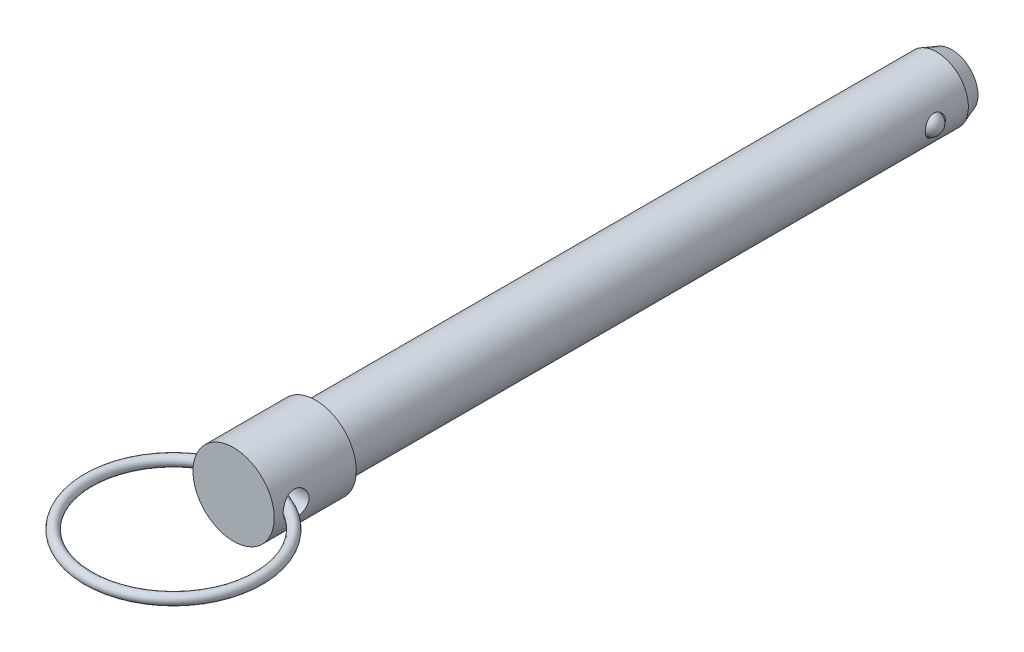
ISO-10303-21;
HEADER;
FILE_DESCRIPTION(('STEP AP214'),'2;1');
FILE_NAME('part.step','',(''),(''),'','','');
FILE_SCHEMA(('AUTOMOTIVE_DESIGN { 1 0 10303 214 1 1 1 1 }'));
ENDSEC;
DATA;
#1=APPLICATION_CONTEXT('core data for automotive mechanical design processes');
#2=APPLICATION_PROTOCOL_DEFINITION('international standard','automotive_design',2000,#1);
#3=PRODUCT_CONTEXT('',#1,'mechanical');
#4=PRODUCT('Part','Part','',(#3));
#5=PRODUCT_RELATED_PRODUCT_CATEGORY('part','',(#4));
#6=PRODUCT_DEFINITION_FORMATION('','',#4);
#7=PRODUCT_DEFINITION_CONTEXT('part definition',#1,'design');
#8=PRODUCT_DEFINITION('design','',#6,#7);
#9=PRODUCT_DEFINITION_SHAPE('','',#8);
#10=(LENGTH_UNIT() NAMED_UNIT(*) SI_UNIT(.MILLI.,.METRE.));
#11=(NAMED_UNIT(*) PLANE_ANGLE_UNIT() SI_UNIT($,.RADIAN.));
#12=(NAMED_UNIT(*) SI_UNIT($,.STERADIAN.) SOLID_ANGLE_UNIT());
#13=UNCERTAINTY_MEASURE_WITH_UNIT(LENGTH_MEASURE(1.E-05),#10,'distance_accuracy_value','');
#14=(GEOMETRIC_REPRESENTATION_CONTEXT(3) GLOBAL_UNCERTAINTY_ASSIGNED_CONTEXT((#13)) GLOBAL_UNIT_ASSIGNED_CONTEXT((#10,
#11,#12)) REPRESENTATION_CONTEXT('',''));
#15=CARTESIAN_POINT('',(0.,0.,0.));
#16=DIRECTION('',(0.,0.,1.));
#17=DIRECTION('',(1.,0.,0.));
#18=AXIS2_PLACEMENT_3D('',#15,#16,#17);
#19=CARTESIAN_POINT('',(7.9375,0.,9.398));
#20=DIRECTION('',(-1.,0.,0.));
#21=DIRECTION('',(0.,0.,-1.));
#22=AXIS2_PLACEMENT_3D('',#19,#20,#21);
#23=CYLINDRICAL_SURFACE('',#22,2.0193);
#24=CARTESIAN_POINT('',(-6.3502,0.292157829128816,11.3960531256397));
#25=CARTESIAN_POINT('',(-6.33446408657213,0.26236172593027,11.4004344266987));
#26=CARTESIAN_POINT('',(-6.32102794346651,0.231225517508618,11.4042829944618));
#27=CARTESIAN_POINT('',(-6.2992523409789,0.167152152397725,11.4106204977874));
#28=CARTESIAN_POINT('',(-6.29090461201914,0.134218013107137,11.413111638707));
#29=CARTESIAN_POINT('',(-6.27972917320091,0.0672091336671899,11.4164621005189));
#30=CARTESIAN_POINT('',(-6.27692077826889,0.0331308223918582,11.4173157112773));
#31=CARTESIAN_POINT('',(-6.27702601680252,-0.0350157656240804,11.4172838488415));
#32=CARTESIAN_POINT('',(-6.27993956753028,-0.0690840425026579,11.4163984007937));
#33=CARTESIAN_POINT('',(-6.29126629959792,-0.135748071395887,11.4130038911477));
#34=CARTESIAN_POINT('',(-6.2996097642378,-0.168356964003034,11.4105154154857));
#35=CARTESIAN_POINT('',(-6.32127848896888,-0.231802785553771,11.404211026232));
#36=CARTESIAN_POINT('',(-6.33461136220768,-0.262636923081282,11.4003930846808));
#37=CARTESIAN_POINT('',(-6.3502,-0.292157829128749,11.3960531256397));
#38=B_SPLINE_CURVE_WITH_KNOTS('',3,(#24,#25,#26,#27,#28,#29,#30,#31,#32,#33,#34,#35,#36,#37),
.UNSPECIFIED.,.F.,.F.,(4,2,2,2,2,2,4),(0.,0.10189986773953,0.203633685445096,0.305721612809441,
0.407808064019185,0.508608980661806,0.609564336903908),.UNSPECIFIED.);
#39=CARTESIAN_POINT('',(-6.3438349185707,0.279747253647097,11.3978284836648));
#40=VERTEX_POINT('',#39);
#41=CARTESIAN_POINT('',(-6.34383491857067,-0.279747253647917,11.3978284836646));
#42=VERTEX_POINT('',#41);
#43=EDGE_CURVE('E40',#40,#42,#38,.T.);
#44=ORIENTED_EDGE('',*,*,#43,.F.);
#45=CARTESIAN_POINT('',(-6.35,0.,11.4173));
#46=CARTESIAN_POINT('',(-6.34999578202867,-0.110312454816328,11.417293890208));
#47=CARTESIAN_POINT('',(-6.34709412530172,-0.220741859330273,11.4082188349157));
#48=CARTESIAN_POINT('',(-6.3357852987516,-0.438477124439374,11.3722159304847));
#49=CARTESIAN_POINT('',(-6.3273687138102,-0.545777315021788,11.3452575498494));
#50=CARTESIAN_POINT('',(-6.30595235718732,-0.753914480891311,11.2744960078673));
#51=CARTESIAN_POINT('',(-6.29296259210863,-0.85476500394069,11.2307296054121));
#52=CARTESIAN_POINT('',(-6.26374009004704,-1.04765917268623,11.1277235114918));
#53=CARTESIAN_POINT('',(-6.24750783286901,-1.13970411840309,11.0684861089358));
#54=CARTESIAN_POINT('',(-6.2129360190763,-1.31536123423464,10.9342184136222));
#55=CARTESIAN_POINT('',(-6.19454917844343,-1.39865352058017,10.8587818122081));
#56=CARTESIAN_POINT('',(-6.15801023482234,-1.55164747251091,10.6951184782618));
#57=CARTESIAN_POINT('',(-6.13985819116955,-1.62134576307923,10.606888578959));
#58=CARTESIAN_POINT('',(-6.1053372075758,-1.74691684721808,10.4173629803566));
#59=CARTESIAN_POINT('',(-6.08902613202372,-1.80238797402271,10.315789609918));
#60=CARTESIAN_POINT('',(-6.06074349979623,-1.89532725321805,10.104153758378));
#61=CARTESIAN_POINT('',(-6.04877073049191,-1.93280043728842,9.99409365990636));
#62=CARTESIAN_POINT('',(-6.03101341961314,-1.9875076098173,9.77220930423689));
#63=CARTESIAN_POINT('',(-6.0250482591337,-2.00533395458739,9.66054596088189));
#64=CARTESIAN_POINT('',(-6.01944581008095,-2.02209234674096,9.43566621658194));
#65=CARTESIAN_POINT('',(-6.01980677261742,-2.02102961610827,9.32245025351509));
#66=CARTESIAN_POINT('',(-6.02665663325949,-2.0005025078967,9.10261826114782));
#67=CARTESIAN_POINT('',(-6.03289303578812,-1.98179631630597,8.99592223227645));
#68=CARTESIAN_POINT('',(-6.05038018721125,-1.92774435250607,8.78726894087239));
#69=CARTESIAN_POINT('',(-6.06163151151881,-1.89239667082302,8.68531222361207));
#70=CARTESIAN_POINT('',(-6.08807105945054,-1.80553890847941,8.48724541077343));
#71=CARTESIAN_POINT('',(-6.1033159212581,-1.75379385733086,8.39124624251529));
#72=CARTESIAN_POINT('',(-6.13599834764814,-1.63577635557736,8.20905256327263));
#73=CARTESIAN_POINT('',(-6.15343637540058,-1.56950083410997,8.12286013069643));
#74=CARTESIAN_POINT('',(-6.18954615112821,-1.42061516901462,7.95845350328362));
#75=CARTESIAN_POINT('',(-6.20823733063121,-1.33738288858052,7.88080597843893));
#76=CARTESIAN_POINT('',(-6.2440320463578,-1.15881168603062,7.74040227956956));
#77=CARTESIAN_POINT('',(-6.26113489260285,-1.06346754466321,7.67765255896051));
#78=CARTESIAN_POINT('',(-6.29201953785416,-0.862230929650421,7.56842117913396));
#79=CARTESIAN_POINT('',(-6.30576997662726,-0.756251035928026,7.5220914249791));
#80=CARTESIAN_POINT('',(-6.32815272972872,-0.537579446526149,7.448167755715));
#81=CARTESIAN_POINT('',(-6.3367955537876,-0.42490206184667,7.4205353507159));
#82=CARTESIAN_POINT('',(-6.34491251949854,-0.259333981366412,7.39474486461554));
#83=CARTESIAN_POINT('',(-6.3468148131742,-0.207677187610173,7.38873516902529));
#84=CARTESIAN_POINT('',(-6.34935954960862,-0.104022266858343,7.38071129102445));
#85=CARTESIAN_POINT('',(-6.35000198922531,-0.0520241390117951,7.37869711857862));
#86=CARTESIAN_POINT('',(-6.34999578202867,0.110312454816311,7.37870610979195));
#87=CARTESIAN_POINT('',(-6.34709412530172,0.220741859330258,7.38778116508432));
#88=CARTESIAN_POINT('',(-6.33578529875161,0.438477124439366,7.4237840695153));
#89=CARTESIAN_POINT('',(-6.32736871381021,0.545777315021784,7.45074245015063));
#90=CARTESIAN_POINT('',(-6.30595235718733,0.753914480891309,7.52150399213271));
#91=CARTESIAN_POINT('',(-6.29296259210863,0.854765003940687,7.56527039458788));
#92=CARTESIAN_POINT('',(-6.26374009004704,1.04765917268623,7.66827648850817));
#93=CARTESIAN_POINT('',(-6.24750783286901,1.13970411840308,7.72751389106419));
#94=CARTESIAN_POINT('',(-6.2129360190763,1.31536123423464,7.86178158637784));
#95=CARTESIAN_POINT('',(-6.19454917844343,1.39865352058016,7.93721818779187));
#96=CARTESIAN_POINT('',(-6.15801023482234,1.55164747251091,8.10088152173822));
#97=CARTESIAN_POINT('',(-6.13985819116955,1.62134576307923,8.18911142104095));
#98=CARTESIAN_POINT('',(-6.1053372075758,1.74691684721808,8.37863701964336));
#99=CARTESIAN_POINT('',(-6.08902613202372,1.80238797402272,8.48021039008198));
#100=CARTESIAN_POINT('',(-6.06074349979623,1.89532725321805,8.69184624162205));
#101=CARTESIAN_POINT('',(-6.04877073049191,1.93280043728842,8.80190634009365));
#102=CARTESIAN_POINT('',(-6.03101341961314,1.9875076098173,9.02379069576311));
#103=CARTESIAN_POINT('',(-6.0250482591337,2.00533395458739,9.13545403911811));
#104=CARTESIAN_POINT('',(-6.01944581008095,2.02209234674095,9.36033378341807));
#105=CARTESIAN_POINT('',(-6.01980677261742,2.02102961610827,9.47354974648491));
#106=CARTESIAN_POINT('',(-6.02665663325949,2.00050250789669,9.69338173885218));
#107=CARTESIAN_POINT('',(-6.03289303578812,1.98179631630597,9.80007776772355));
#108=CARTESIAN_POINT('',(-6.05038018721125,1.92774435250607,10.0087310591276));
#109=CARTESIAN_POINT('',(-6.06163151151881,1.89239667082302,10.1106877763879));
#110=CARTESIAN_POINT('',(-6.08807105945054,1.80553890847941,10.3087545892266));
#111=CARTESIAN_POINT('',(-6.1033159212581,1.75379385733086,10.4047537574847));
#112=CARTESIAN_POINT('',(-6.13599834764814,1.63577635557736,10.5869474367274));
#113=CARTESIAN_POINT('',(-6.15343637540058,1.56950083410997,10.6731398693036));
#114=CARTESIAN_POINT('',(-6.18954615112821,1.42061516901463,10.8375464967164));
#115=CARTESIAN_POINT('',(-6.20823733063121,1.33738288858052,10.9151940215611));
#116=CARTESIAN_POINT('',(-6.2440320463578,1.15881168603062,11.0555977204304));
#117=CARTESIAN_POINT('',(-6.26113489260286,1.06346754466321,11.1183474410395));
#118=CARTESIAN_POINT('',(-6.29201953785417,0.862230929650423,11.227578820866));
#119=CARTESIAN_POINT('',(-6.30576997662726,0.756251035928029,11.2739085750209));
#120=CARTESIAN_POINT('',(-6.32815272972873,0.53757944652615,11.347832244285));
#121=CARTESIAN_POINT('',(-6.33679555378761,0.424902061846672,11.3754646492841));
#122=CARTESIAN_POINT('',(-6.34491251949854,0.25933398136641,11.4012551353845));
#123=CARTESIAN_POINT('',(-6.34681481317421,0.207677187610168,11.4072648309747));
#124=CARTESIAN_POINT('',(-6.34935954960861,0.10402226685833,11.4152887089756));
#125=CARTESIAN_POINT('',(-6.35000198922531,0.0520241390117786,11.4173028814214));
#126=CARTESIAN_POINT('',(-6.35,0.,11.4173));
#127=B_SPLINE_CURVE_WITH_KNOTS('',3,(#45,#46,#47,#48,#49,#50,#51,#52,#53,#54,#55,#56,#57,#58,
#59,#60,#61,#62,#63,#64,#65,#66,#67,#68,#69,#70,#71,#72,#73,#74,#75,#76,#77,#78,#79,#80,#81,#82,
#83,#84,#85,#86,#87,#88,#89,#90,#91,#92,#93,#94,#95,#96,#97,#98,#99,#100,#101,#102,#103,#104,
#105,#106,#107,#108,#109,#110,#111,#112,#113,#114,#115,#116,#117,#118,#119,#120,#121,#122,#123,
#124,#125,#126),.UNSPECIFIED.,.T.,.F.,(4,2,2,2,2,2,2,2,2,2,2,2,2,2,2,2,2,2,2,2,2,2,2,2,2,2,2,2,
2,2,2,2,2,2,2,2,2,2,2,2,4),(0.,0.33073688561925,0.662039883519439,0.992622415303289,
1.32315606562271,1.66322530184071,2.00337886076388,2.35228054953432,2.70108463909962,
3.0390572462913,3.37693642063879,3.70092724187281,4.02495524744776,4.35385413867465,
4.68282260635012,5.02727904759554,5.37188442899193,5.71959937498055,6.06659632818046,
6.22257380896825,6.37855167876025,6.70928856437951,7.04059156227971,7.37117409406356,
7.70170774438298,8.04177698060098,8.38193053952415,8.73083222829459,9.0796363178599,
9.41760892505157,9.75548809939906,10.0794789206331,10.403506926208,10.7324058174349,
11.0613742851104,11.4058307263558,11.7504361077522,12.0981510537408,12.4451480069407,
12.6011254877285,12.7571033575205),.UNSPECIFIED.);
#128=EDGE_CURVE('E66',#42,#40,#127,.T.);
#129=ORIENTED_EDGE('',*,*,#128,.F.);
#130=EDGE_LOOP('',(#44,#129));
#131=FACE_BOUND('',#130,.T.);
#132=CARTESIAN_POINT('',(6.3502,-0.292157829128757,11.3960531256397));
#133=CARTESIAN_POINT('',(6.33446408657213,-0.262361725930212,11.4004344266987));
#134=CARTESIAN_POINT('',(6.3210279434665,-0.23122551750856,11.4042829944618));
#135=CARTESIAN_POINT('',(6.29925234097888,-0.167152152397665,11.4106204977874));
#136=CARTESIAN_POINT('',(6.29090461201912,-0.134218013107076,11.413111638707));
#137=CARTESIAN_POINT('',(6.27972917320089,-0.067209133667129,11.4164621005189));
#138=CARTESIAN_POINT('',(6.27692077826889,-0.0331308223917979,11.4173157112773));
#139=CARTESIAN_POINT('',(6.27702601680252,0.0350157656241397,11.4172838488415));
#140=CARTESIAN_POINT('',(6.27993956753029,0.0690840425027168,11.4163984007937));
#141=CARTESIAN_POINT('',(6.29126629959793,0.135748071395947,11.4130038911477));
#142=CARTESIAN_POINT('',(6.29960976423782,0.168356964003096,11.4105154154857));
#143=CARTESIAN_POINT('',(6.3212784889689,0.231802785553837,11.4042110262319));
#144=CARTESIAN_POINT('',(6.3346113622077,0.262636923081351,11.4003930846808));
#145=CARTESIAN_POINT('',(6.3502,0.292157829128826,11.3960531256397));
#146=B_SPLINE_CURVE_WITH_KNOTS('',3,(#132,#133,#134,#135,#136,#137,#138,#139,#140,#141,#142,
#143,#144,#145),.UNSPECIFIED.,.F.,.F.,(4,2,2,2,2,2,4),(0.,0.101899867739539,0.203633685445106,
0.305721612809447,0.40780806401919,0.508608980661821,0.609564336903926),.UNSPECIFIED.);
#147=CARTESIAN_POINT('',(6.3438349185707,-0.279747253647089,11.3978284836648));
#148=VERTEX_POINT('',#147);
#149=CARTESIAN_POINT('',(6.34383491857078,0.279747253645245,11.397828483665));
#150=VERTEX_POINT('',#149);
#151=EDGE_CURVE('E33',#148,#150,#146,.T.);
#152=ORIENTED_EDGE('',*,*,#151,.F.);
#153=CARTESIAN_POINT('',(6.35,0.,7.3787));
#154=CARTESIAN_POINT('',(6.34999578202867,-0.110312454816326,7.37870610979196));
#155=CARTESIAN_POINT('',(6.34709412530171,-0.22074185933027,7.38778116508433));
#156=CARTESIAN_POINT('',(6.3357852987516,-0.438477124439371,7.4237840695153));
#157=CARTESIAN_POINT('',(6.32736871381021,-0.545777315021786,7.45074245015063));
#158=CARTESIAN_POINT('',(6.30595235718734,-0.753914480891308,7.52150399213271));
#159=CARTESIAN_POINT('',(6.29296259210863,-0.854765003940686,7.56527039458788));
#160=CARTESIAN_POINT('',(6.26374009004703,-1.04765917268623,7.66827648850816));
#161=CARTESIAN_POINT('',(6.247507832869,-1.13970411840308,7.72751389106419));
#162=CARTESIAN_POINT('',(6.21293601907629,-1.31536123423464,7.86178158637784));
#163=CARTESIAN_POINT('',(6.19454917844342,-1.39865352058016,7.93721818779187));
#164=CARTESIAN_POINT('',(6.15801023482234,-1.55164747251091,8.10088152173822));
#165=CARTESIAN_POINT('',(6.13985819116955,-1.62134576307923,8.18911142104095));
#166=CARTESIAN_POINT('',(6.1053372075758,-1.74691684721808,8.37863701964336));
#167=CARTESIAN_POINT('',(6.08902613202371,-1.80238797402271,8.48021039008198));
#168=CARTESIAN_POINT('',(6.06074349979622,-1.89532725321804,8.69184624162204));
#169=CARTESIAN_POINT('',(6.04877073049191,-1.93280043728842,8.80190634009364));
#170=CARTESIAN_POINT('',(6.03101341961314,-1.9875076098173,9.02379069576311));
#171=CARTESIAN_POINT('',(6.02504825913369,-2.00533395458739,9.13545403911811));
#172=CARTESIAN_POINT('',(6.01944581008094,-2.02209234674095,9.36033378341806));
#173=CARTESIAN_POINT('',(6.01980677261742,-2.02102961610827,9.47354974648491));
#174=CARTESIAN_POINT('',(6.02665663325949,-2.00050250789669,9.69338173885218));
#175=CARTESIAN_POINT('',(6.03289303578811,-1.98179631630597,9.80007776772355));
#176=CARTESIAN_POINT('',(6.05038018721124,-1.92774435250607,10.0087310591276));
#177=CARTESIAN_POINT('',(6.06163151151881,-1.89239667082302,10.1106877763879));
#178=CARTESIAN_POINT('',(6.08807105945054,-1.80553890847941,10.3087545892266));
#179=CARTESIAN_POINT('',(6.1033159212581,-1.75379385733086,10.4047537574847));
#180=CARTESIAN_POINT('',(6.13599834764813,-1.63577635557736,10.5869474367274));
#181=CARTESIAN_POINT('',(6.15343637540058,-1.56950083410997,10.6731398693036));
#182=CARTESIAN_POINT('',(6.18954615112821,-1.42061516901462,10.8375464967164));
#183=CARTESIAN_POINT('',(6.2082373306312,-1.33738288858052,10.9151940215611));
#184=CARTESIAN_POINT('',(6.24403204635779,-1.15881168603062,11.0555977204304));
#185=CARTESIAN_POINT('',(6.26113489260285,-1.06346754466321,11.1183474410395));
#186=CARTESIAN_POINT('',(6.29201953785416,-0.862230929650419,11.227578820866));
#187=CARTESIAN_POINT('',(6.30576997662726,-0.756251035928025,11.2739085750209));
#188=CARTESIAN_POINT('',(6.32815272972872,-0.537579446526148,11.347832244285));
#189=CARTESIAN_POINT('',(6.3367955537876,-0.424902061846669,11.3754646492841));
#190=CARTESIAN_POINT('',(6.34491251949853,-0.25933398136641,11.4012551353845));
#191=CARTESIAN_POINT('',(6.3468148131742,-0.207677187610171,11.4072648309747));
#192=CARTESIAN_POINT('',(6.34935954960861,-0.10402226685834,11.4152887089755));
#193=CARTESIAN_POINT('',(6.35000198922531,-0.0520241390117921,11.4173028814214));
#194=CARTESIAN_POINT('',(6.34999578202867,0.110312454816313,11.417293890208));
#195=CARTESIAN_POINT('',(6.34709412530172,0.220741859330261,11.4082188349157));
#196=CARTESIAN_POINT('',(6.33578529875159,0.438477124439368,11.3722159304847));
#197=CARTESIAN_POINT('',(6.3273687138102,0.545777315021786,11.3452575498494));
#198=CARTESIAN_POINT('',(6.30595235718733,0.753914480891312,11.2744960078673));
#199=CARTESIAN_POINT('',(6.29296259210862,0.854765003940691,11.2307296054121));
#200=CARTESIAN_POINT('',(6.26374009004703,1.04765917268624,11.1277235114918));
#201=CARTESIAN_POINT('',(6.247507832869,1.13970411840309,11.0684861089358));
#202=CARTESIAN_POINT('',(6.21293601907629,1.31536123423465,10.9342184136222));
#203=CARTESIAN_POINT('',(6.19454917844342,1.39865352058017,10.8587818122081));
#204=CARTESIAN_POINT('',(6.15801023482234,1.55164747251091,10.6951184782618));
#205=CARTESIAN_POINT('',(6.13985819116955,1.62134576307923,10.606888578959));
#206=CARTESIAN_POINT('',(6.1053372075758,1.74691684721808,10.4173629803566));
#207=CARTESIAN_POINT('',(6.08902613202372,1.80238797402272,10.315789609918));
#208=CARTESIAN_POINT('',(6.06074349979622,1.89532725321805,10.104153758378));
#209=CARTESIAN_POINT('',(6.0487707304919,1.93280043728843,9.99409365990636));
#210=CARTESIAN_POINT('',(6.03101341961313,1.9875076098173,9.77220930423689));
#211=CARTESIAN_POINT('',(6.02504825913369,2.0053339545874,9.66054596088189));
#212=CARTESIAN_POINT('',(6.01944581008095,2.02209234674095,9.43566621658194));
#213=CARTESIAN_POINT('',(6.01980677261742,2.02102961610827,9.32245025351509));
#214=CARTESIAN_POINT('',(6.02665663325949,2.00050250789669,9.10261826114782));
#215=CARTESIAN_POINT('',(6.03289303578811,1.98179631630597,8.99592223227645));
#216=CARTESIAN_POINT('',(6.05038018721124,1.92774435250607,8.78726894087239));
#217=CARTESIAN_POINT('',(6.06163151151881,1.89239667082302,8.68531222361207));
#218=CARTESIAN_POINT('',(6.08807105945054,1.80553890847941,8.48724541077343));
#219=CARTESIAN_POINT('',(6.1033159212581,1.75379385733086,8.39124624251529));
#220=CARTESIAN_POINT('',(6.13599834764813,1.63577635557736,8.20905256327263));
#221=CARTESIAN_POINT('',(6.15343637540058,1.56950083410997,8.12286013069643));
#222=CARTESIAN_POINT('',(6.18954615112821,1.42061516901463,7.95845350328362));
#223=CARTESIAN_POINT('',(6.2082373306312,1.33738288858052,7.88080597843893));
#224=CARTESIAN_POINT('',(6.24403204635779,1.15881168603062,7.74040227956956));
#225=CARTESIAN_POINT('',(6.26113489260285,1.06346754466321,7.67765255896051));
#226=CARTESIAN_POINT('',(6.29201953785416,0.862230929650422,7.56842117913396));
#227=CARTESIAN_POINT('',(6.30576997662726,0.756251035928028,7.5220914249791));
#228=CARTESIAN_POINT('',(6.32815272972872,0.53757944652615,7.448167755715));
#229=CARTESIAN_POINT('',(6.3367955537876,0.424902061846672,7.4205353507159));
#230=CARTESIAN_POINT('',(6.34491251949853,0.25933398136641,7.39474486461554));
#231=CARTESIAN_POINT('',(6.3468148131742,0.207677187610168,7.38873516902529));
#232=CARTESIAN_POINT('',(6.34935954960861,0.104022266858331,7.38071129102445));
#233=CARTESIAN_POINT('',(6.35000198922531,0.0520241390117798,7.37869711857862));
#234=CARTESIAN_POINT('',(6.35,0.,7.3787));
#235=B_SPLINE_CURVE_WITH_KNOTS('',3,(#153,#154,#155,#156,#157,#158,#159,#160,#161,#162,#163,
#164,#165,#166,#167,#168,#169,#170,#171,#172,#173,#174,#175,#176,#177,#178,#179,#180,#181,#182,
#183,#184,#185,#186,#187,#188,#189,#190,#191,#192,#193,#194,#195,#196,#197,#198,#199,#200,#201,
#202,#203,#204,#205,#206,#207,#208,#209,#210,#211,#212,#213,#214,#215,#216,#217,#218,#219,#220,
#221,#222,#223,#224,#225,#226,#227,#228,#229,#230,#231,#232,#233,#234),.UNSPECIFIED.,.T.,.F.,(4,
2,2,2,2,2,2,2,2,2,2,2,2,2,2,2,2,2,2,2,2,2,2,2,2,2,2,2,2,2,2,2,2,2,2,2,2,2,2,2,4),(0.,
0.330736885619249,0.662039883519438,0.992622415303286,1.32315606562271,1.66322530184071,
2.00337886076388,2.35228054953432,2.70108463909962,3.0390572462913,3.37693642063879,
3.7009272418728,4.02495524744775,4.35385413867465,4.68282260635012,5.02727904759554,
5.37188442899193,5.71959937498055,6.06659632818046,6.22257380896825,6.37855167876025,
6.70928856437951,7.04059156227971,7.37117409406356,7.70170774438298,8.04177698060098,
8.38193053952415,8.73083222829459,9.07963631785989,9.41760892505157,9.75548809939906,
10.0794789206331,10.403506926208,10.7324058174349,11.0613742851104,11.4058307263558,
11.7504361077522,12.0981510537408,12.4451480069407,12.6011254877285,12.7571033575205),.UNSPECIFIED.);
#236=EDGE_CURVE('E62',#150,#148,#235,.T.);
#237=ORIENTED_EDGE('',*,*,#236,.F.);
#238=EDGE_LOOP('',(#152,#237));
#239=FACE_BOUND('',#238,.T.);
#240=ADVANCED_FACE('F14',(#131,#239),#23,.F.);
#241=CARTESIAN_POINT('',(0.,0.,-34.39922));
#242=DIRECTION('',(0.,0.,-1.));
#243=DIRECTION('',(1.,0.,0.));
#244=AXIS2_PLACEMENT_3D('',#241,#242,#243);
#245=CYLINDRICAL_SURFACE('',#244,6.35);
#246=ORIENTED_EDGE('',*,*,#236,.T.);
#247=CARTESIAN_POINT('',(6.34911067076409,-0.106292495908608,9.64531337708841));
#248=CARTESIAN_POINT('',(6.3483941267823,-0.149074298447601,9.65137725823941));
#249=CARTESIAN_POINT('',(6.34724965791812,-0.191344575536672,9.66110939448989));
#250=CARTESIAN_POINT('',(6.34423605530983,-0.273618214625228,9.68758101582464));
#251=CARTESIAN_POINT('',(6.34236646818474,-0.313620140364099,9.704324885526));
#252=CARTESIAN_POINT('',(6.3381174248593,-0.39017545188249,9.74421775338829));
#253=CARTESIAN_POINT('',(6.33573876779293,-0.426734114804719,9.76735672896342));
#254=CARTESIAN_POINT('',(6.33072830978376,-0.495552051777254,9.8192835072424));
#255=CARTESIAN_POINT('',(6.32809652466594,-0.527811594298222,9.84807095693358));
#256=CARTESIAN_POINT('',(6.32277775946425,-0.588154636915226,9.91124388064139));
#257=CARTESIAN_POINT('',(6.32009122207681,-0.616100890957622,9.94576018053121));
#258=CARTESIAN_POINT('',(6.31500218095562,-0.666246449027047,10.0187508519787));
#259=CARTESIAN_POINT('',(6.31259974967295,-0.688444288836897,10.0572262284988));
#260=CARTESIAN_POINT('',(6.30814194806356,-0.728200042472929,10.1398945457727));
#261=CARTESIAN_POINT('',(6.30612298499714,-0.745320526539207,10.1842993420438));
#262=CARTESIAN_POINT('',(6.30283333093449,-0.772645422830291,10.2752074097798));
#263=CARTESIAN_POINT('',(6.30156294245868,-0.782847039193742,10.3217115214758));
#264=CARTESIAN_POINT('',(6.2997729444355,-0.797132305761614,10.4203656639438));
#265=CARTESIAN_POINT('',(6.29934001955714,-0.800511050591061,10.4726191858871));
#266=CARTESIAN_POINT('',(6.29948539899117,-0.79936334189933,10.5770343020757));
#267=CARTESIAN_POINT('',(6.30006412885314,-0.794833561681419,10.6291958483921));
#268=CARTESIAN_POINT('',(6.30224519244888,-0.777362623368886,10.7373900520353));
#269=CARTESIAN_POINT('',(6.30394321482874,-0.763632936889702,10.7932945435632));
#270=CARTESIAN_POINT('',(6.3082304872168,-0.727364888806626,10.9021925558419));
#271=CARTESIAN_POINT('',(6.31082057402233,-0.704818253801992,10.9551832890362));
#272=CARTESIAN_POINT('',(6.31668084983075,-0.650249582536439,11.058462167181));
#273=CARTESIAN_POINT('',(6.31997188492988,-0.617920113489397,11.108588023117));
#274=CARTESIAN_POINT('',(6.32672369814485,-0.544444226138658,11.2018715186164));
#275=CARTESIAN_POINT('',(6.33018413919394,-0.503314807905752,11.2450423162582));
#276=CARTESIAN_POINT('',(6.33576833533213,-0.426106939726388,11.3105875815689));
#277=CARTESIAN_POINT('',(6.3379874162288,-0.39205867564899,11.3353540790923));
#278=CARTESIAN_POINT('',(6.34201635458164,-0.32033474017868,11.378985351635));
#279=CARTESIAN_POINT('',(6.34382654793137,-0.282662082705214,11.3978549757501));
#280=CARTESIAN_POINT('',(6.34683709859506,-0.204222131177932,11.4286907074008));
#281=CARTESIAN_POINT('',(6.34803303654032,-0.163434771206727,11.4406068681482));
#282=CARTESIAN_POINT('',(6.34962760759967,-0.0803154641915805,11.456409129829));
#283=CARTESIAN_POINT('',(6.35002678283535,-0.0379845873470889,11.4603006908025));
#284=CARTESIAN_POINT('',(6.34997361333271,0.0416311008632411,11.4597766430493));
#285=CARTESIAN_POINT('',(6.34961570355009,0.0789250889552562,11.4562823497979));
#286=CARTESIAN_POINT('',(6.34827799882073,0.152365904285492,11.4430416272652));
#287=CARTESIAN_POINT('',(6.34729819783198,0.188512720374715,11.4332951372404));
#288=CARTESIAN_POINT('',(6.34483463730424,0.258437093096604,11.4082426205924));
#289=CARTESIAN_POINT('',(6.34335520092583,0.292232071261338,11.392984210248));
#290=CARTESIAN_POINT('',(6.3400309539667,0.357164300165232,11.3576448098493));
#291=CARTESIAN_POINT('',(6.33818602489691,0.388300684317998,11.3375622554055));
#292=CARTESIAN_POINT('',(6.33403341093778,0.451264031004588,11.2905464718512));
#293=CARTESIAN_POINT('',(6.33169671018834,0.482680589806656,11.2630681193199));
#294=CARTESIAN_POINT('',(6.32695276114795,0.54132798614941,11.2039742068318));
#295=CARTESIAN_POINT('',(6.32454547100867,0.568556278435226,11.1723561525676));
#296=CARTESIAN_POINT('',(6.31940966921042,0.623257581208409,11.0997303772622));
#297=CARTESIAN_POINT('',(6.31670324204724,0.649859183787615,11.0580641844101));
#298=CARTESIAN_POINT('',(6.31169900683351,0.696787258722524,10.9713122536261));
#299=CARTESIAN_POINT('',(6.30940147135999,0.717109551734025,10.9262242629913));
#300=CARTESIAN_POINT('',(6.30511939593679,0.753900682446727,10.8265682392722));
#301=CARTESIAN_POINT('',(6.30323580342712,0.76931139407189,10.7716021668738));
#302=CARTESIAN_POINT('',(6.30052520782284,0.791204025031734,10.6598731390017));
#303=CARTESIAN_POINT('',(6.2996986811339,0.797681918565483,10.6031093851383));
#304=CARTESIAN_POINT('',(6.29923241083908,0.801360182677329,10.4867557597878));
#305=CARTESIAN_POINT('',(6.2996462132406,0.798141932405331,10.4271509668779));
#306=CARTESIAN_POINT('',(6.30178827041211,0.781050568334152,10.3094933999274));
#307=CARTESIAN_POINT('',(6.30351599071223,0.767181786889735,10.2514400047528));
#308=CARTESIAN_POINT('',(6.30793273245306,0.729936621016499,10.1430301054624));
#309=CARTESIAN_POINT('',(6.31054579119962,0.707295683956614,10.0924193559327));
#310=CARTESIAN_POINT('',(6.316412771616,0.652821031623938,9.99644731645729));
#311=CARTESIAN_POINT('',(6.31966615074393,0.620995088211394,9.95108163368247));
#312=CARTESIAN_POINT('',(6.3259599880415,0.55295430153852,9.87232840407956));
#313=CARTESIAN_POINT('',(6.32898344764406,0.51763102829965,9.83816824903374));
#314=CARTESIAN_POINT('',(6.33476504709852,0.441261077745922,9.77694761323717));
#315=CARTESIAN_POINT('',(6.33752330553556,0.400216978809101,9.74988394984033));
#316=CARTESIAN_POINT('',(6.34218417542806,0.31744024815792,9.70596453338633));
#317=CARTESIAN_POINT('',(6.34413984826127,0.276067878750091,9.68843287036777));
#318=CARTESIAN_POINT('',(6.34727291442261,0.190881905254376,9.66089843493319));
#319=CARTESIAN_POINT('',(6.34845102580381,0.147070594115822,9.65088871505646));
#320=CARTESIAN_POINT('',(6.34972965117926,0.0681015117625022,9.64007587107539));
#321=CARTESIAN_POINT('',(6.35000959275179,0.0331486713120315,9.63773711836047));
#322=CARTESIAN_POINT('',(6.34998989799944,-0.0367451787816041,9.63790342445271));
#323=CARTESIAN_POINT('',(6.34969028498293,-0.071686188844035,9.64040828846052));
#324=CARTESIAN_POINT('',(6.34911067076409,-0.106292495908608,9.64531337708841));
#325=B_SPLINE_CURVE_WITH_KNOTS('',3,(#247,#248,#249,#250,#251,#252,#253,#254,#255,#256,#257,
#258,#259,#260,#261,#262,#263,#264,#265,#266,#267,#268,#269,#270,#271,#272,#273,#274,#275,#276,
#277,#278,#279,#280,#281,#282,#283,#284,#285,#286,#287,#288,#289,#290,#291,#292,#293,#294,#295,
#296,#297,#298,#299,#300,#301,#302,#303,#304,#305,#306,#307,#308,#309,#310,#311,#312,#313,#314,
#315,#316,#317,#318,#319,#320,#321,#322,#323,#324),.UNSPECIFIED.,.T.,.F.,(4,2,2,2,2,2,2,2,2,2,2,
2,2,2,2,2,2,2,2,2,2,2,2,2,2,2,2,2,2,2,2,2,2,2,2,2,2,2,4),(0.,0.129515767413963,
0.259112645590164,0.388507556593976,0.517894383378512,0.650795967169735,0.783731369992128,
0.926038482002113,1.06840306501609,1.22484845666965,1.38135967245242,1.55336962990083,
1.72554138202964,1.90381365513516,2.08174459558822,2.2077364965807,2.33362451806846,
2.4604060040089,2.58710119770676,2.6989276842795,2.81075525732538,2.92163901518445,
3.03255877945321,3.15750232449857,3.28252150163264,3.43047497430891,3.57852670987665,
3.74912471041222,3.91979957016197,4.09794717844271,4.27602235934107,4.44160182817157,
4.60704160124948,4.75394079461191,4.90077399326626,5.03502725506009,5.16915636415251,
5.27392620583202,5.37869183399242),.UNSPECIFIED.);
#326=EDGE_CURVE('E27',#148,#150,#325,.T.);
#327=ORIENTED_EDGE('',*,*,#326,.T.);
#328=EDGE_LOOP('',(#246,#327));
#329=FACE_BOUND('',#328,.T.);
#330=CARTESIAN_POINT('',(0.,0.,12.8270000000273));
#331=DIRECTION('',(0.,0.,-1.));
#332=DIRECTION('',(1.,0.,0.));
#333=AXIS2_PLACEMENT_3D('',#330,#331,#332);
#334=CIRCLE('',#333,6.34999999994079);
#335=CARTESIAN_POINT('',(6.34999999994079,0.,12.8270000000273));
#336=VERTEX_POINT('',#335);
#337=EDGE_CURVE('E70',#336,#336,#334,.T.);
#338=ORIENTED_EDGE('',*,*,#337,.T.);
#339=EDGE_LOOP('',(#338));
#340=FACE_BOUND('',#339,.T.);
#341=CARTESIAN_POINT('',(0.,0.,1.16018306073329E-11));
#342=DIRECTION('',(0.,0.,-1.));
#343=DIRECTION('',(1.,0.,0.));
#344=AXIS2_PLACEMENT_3D('',#341,#342,#343);
#345=CIRCLE('',#344,6.34999999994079);
#346=CARTESIAN_POINT('',(6.34999999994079,0.,1.16015507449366E-11));
#347=VERTEX_POINT('',#346);
#348=EDGE_CURVE('E60',#347,#347,#345,.T.);
#349=ORIENTED_EDGE('',*,*,#348,.F.);
#350=EDGE_LOOP('',(#349));
#351=FACE_BOUND('',#350,.T.);
#352=ORIENTED_EDGE('',*,*,#128,.T.);
#353=CARTESIAN_POINT('',(-6.3491106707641,-0.106292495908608,9.64531337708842));
#354=CARTESIAN_POINT('',(-6.34981427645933,-0.0642492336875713,9.63935614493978));
#355=CARTESIAN_POINT('',(-6.35010491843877,-0.0216882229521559,9.63693832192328));
#356=CARTESIAN_POINT('',(-6.34982708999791,0.063245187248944,9.63926820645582));
#357=CARTESIAN_POINT('',(-6.34925830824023,0.105617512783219,9.64401851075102));
#358=CARTESIAN_POINT('',(-6.3473255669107,0.188929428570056,9.66052387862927));
#359=CARTESIAN_POINT('',(-6.34596206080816,0.22986982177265,9.67227494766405));
#360=CARTESIAN_POINT('',(-6.34259173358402,0.309205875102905,9.7023861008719));
#361=CARTESIAN_POINT('',(-6.34058494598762,0.347601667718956,9.72074584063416));
#362=CARTESIAN_POINT('',(-6.33612262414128,0.421219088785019,9.76368889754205));
#363=CARTESIAN_POINT('',(-6.33366281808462,0.456405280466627,9.78833239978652));
#364=CARTESIAN_POINT('',(-6.3285674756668,0.522330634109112,9.84295801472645));
#365=CARTESIAN_POINT('',(-6.32593191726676,0.553069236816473,9.87294079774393));
#366=CARTESIAN_POINT('',(-6.32063739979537,0.610668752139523,9.93869049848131));
#367=CARTESIAN_POINT('',(-6.31798210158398,0.637312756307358,9.97464737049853));
#368=CARTESIAN_POINT('',(-6.31302530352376,0.684675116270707,10.050284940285));
#369=CARTESIAN_POINT('',(-6.31072390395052,0.705391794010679,10.0899666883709));
#370=CARTESIAN_POINT('',(-6.3065253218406,0.74202799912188,10.1750481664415));
#371=CARTESIAN_POINT('',(-6.30467116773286,0.757473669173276,10.2206536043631));
#372=CARTESIAN_POINT('',(-6.30176158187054,0.781309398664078,10.3136897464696));
#373=CARTESIAN_POINT('',(-6.30070647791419,0.789696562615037,10.3611211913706));
#374=CARTESIAN_POINT('',(-6.29939708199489,0.800080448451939,10.4615517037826));
#375=CARTESIAN_POINT('',(-6.29923479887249,0.80134327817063,10.5146278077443));
#376=CARTESIAN_POINT('',(-6.29993274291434,0.795834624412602,10.6203535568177));
#377=CARTESIAN_POINT('',(-6.30079341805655,0.789059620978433,10.6730030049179));
#378=CARTESIAN_POINT('',(-6.30354435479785,0.76679085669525,10.7816321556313));
#379=CARTESIAN_POINT('',(-6.3055245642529,0.750530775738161,10.8374538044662));
#380=CARTESIAN_POINT('',(-6.3103170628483,0.70910618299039,10.9457204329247));
#381=CARTESIAN_POINT('',(-6.31313013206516,0.683933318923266,10.9981621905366));
#382=CARTESIAN_POINT('',(-6.31930287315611,0.624362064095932,11.0989766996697));
#383=CARTESIAN_POINT('',(-6.32267249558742,0.589786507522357,11.1472450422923));
#384=CARTESIAN_POINT('',(-6.32944316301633,0.512016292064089,11.2362287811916));
#385=CARTESIAN_POINT('',(-6.33284412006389,0.468841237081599,11.2769609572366));
#386=CARTESIAN_POINT('',(-6.3381447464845,0.389210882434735,11.3371705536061));
#387=CARTESIAN_POINT('',(-6.34018413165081,0.354783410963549,11.3593300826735));
#388=CARTESIAN_POINT('',(-6.34380499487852,0.282727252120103,11.3976985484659));
#389=CARTESIAN_POINT('',(-6.34538687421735,0.245101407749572,11.4139127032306));
#390=CARTESIAN_POINT('',(-6.34791613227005,0.167280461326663,11.4394899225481));
#391=CARTESIAN_POINT('',(-6.34885950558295,0.12707084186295,11.4488097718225));
#392=CARTESIAN_POINT('',(-6.34996657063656,0.0456031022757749,11.459723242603));
#393=CARTESIAN_POINT('',(-6.35013061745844,0.00434546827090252,11.4613203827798));
#394=CARTESIAN_POINT('',(-6.34968170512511,-0.0735082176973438,11.4569121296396));
#395=CARTESIAN_POINT('',(-6.34914631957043,-0.110150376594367,11.4516658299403));
#396=CARTESIAN_POINT('',(-6.34749195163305,-0.182042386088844,11.4351966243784));
#397=CARTESIAN_POINT('',(-6.3463729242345,-0.217292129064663,11.4239732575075));
#398=CARTESIAN_POINT('',(-6.34364878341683,-0.286046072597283,11.3959879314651));
#399=CARTESIAN_POINT('',(-6.34203717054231,-0.319519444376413,11.379151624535));
#400=CARTESIAN_POINT('',(-6.33848327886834,-0.383617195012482,11.3407750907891));
#401=CARTESIAN_POINT('',(-6.336540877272,-0.414240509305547,11.3192331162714));
#402=CARTESIAN_POINT('',(-6.33219640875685,-0.476327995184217,11.2689534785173));
#403=CARTESIAN_POINT('',(-6.32976799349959,-0.507315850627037,11.2396315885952));
#404=CARTESIAN_POINT('',(-6.32489282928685,-0.564859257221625,11.1769313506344));
#405=CARTESIAN_POINT('',(-6.32244606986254,-0.591412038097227,11.1435504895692));
#406=CARTESIAN_POINT('',(-6.31728331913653,-0.644412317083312,11.0671373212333));
#407=CARTESIAN_POINT('',(-6.31460099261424,-0.669935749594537,11.0234608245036));
#408=CARTESIAN_POINT('',(-6.3097291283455,-0.714365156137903,10.9328329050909));
#409=CARTESIAN_POINT('',(-6.30753991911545,-0.733266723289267,10.8858793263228));
#410=CARTESIAN_POINT('',(-6.30360262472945,-0.766429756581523,10.7829444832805));
#411=CARTESIAN_POINT('',(-6.30196031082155,-0.779660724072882,10.7266239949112));
#412=CARTESIAN_POINT('',(-6.29981098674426,-0.796841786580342,10.6125408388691));
#413=CARTESIAN_POINT('',(-6.29930438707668,-0.800788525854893,10.5547776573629));
#414=CARTESIAN_POINT('',(-6.29954116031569,-0.798927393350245,10.4378617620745));
#415=CARTESIAN_POINT('',(-6.30031766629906,-0.792860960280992,10.3787123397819));
#416=CARTESIAN_POINT('',(-6.3031448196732,-0.770063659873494,10.2625195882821));
#417=CARTESIAN_POINT('',(-6.30519479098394,-0.753338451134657,10.2054751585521));
#418=CARTESIAN_POINT('',(-6.31011127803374,-0.710921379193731,10.100203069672));
#419=CARTESIAN_POINT('',(-6.31289804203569,-0.686067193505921,10.0516355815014));
#420=CARTESIAN_POINT('',(-6.31897863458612,-0.627588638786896,9.96012359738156));
#421=CARTESIAN_POINT('',(-6.32227210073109,-0.593970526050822,9.91717512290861));
#422=CARTESIAN_POINT('',(-6.32851172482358,-0.523028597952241,9.84320836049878));
#423=CARTESIAN_POINT('',(-6.33145578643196,-0.486532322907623,9.81139456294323));
#424=CARTESIAN_POINT('',(-6.33697928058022,-0.408315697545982,9.75500457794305));
#425=CARTESIAN_POINT('',(-6.33955910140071,-0.366601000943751,9.73042065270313));
#426=CARTESIAN_POINT('',(-6.34352567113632,-0.288721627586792,9.69390061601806));
#427=CARTESIAN_POINT('',(-6.34504971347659,-0.253297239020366,9.68038073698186));
#428=CARTESIAN_POINT('',(-6.34752864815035,-0.18081626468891,9.65874203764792));
#429=CARTESIAN_POINT('',(-6.34848364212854,-0.143759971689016,9.65062225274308));
#430=CARTESIAN_POINT('',(-6.3491106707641,-0.106292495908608,9.64531337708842));
#431=B_SPLINE_CURVE_WITH_KNOTS('',3,(#353,#354,#355,#356,#357,#358,#359,#360,#361,#362,#363,
#364,#365,#366,#367,#368,#369,#370,#371,#372,#373,#374,#375,#376,#377,#378,#379,#380,#381,#382,
#383,#384,#385,#386,#387,#388,#389,#390,#391,#392,#393,#394,#395,#396,#397,#398,#399,#400,#401,
#402,#403,#404,#405,#406,#407,#408,#409,#410,#411,#412,#413,#414,#415,#416,#417,#418,#419,#420,
#421,#422,#423,#424,#425,#426,#427,#428,#429,#430),.UNSPECIFIED.,.T.,.F.,(4,2,2,2,2,2,2,2,2,2,2,
2,2,2,2,2,2,2,2,2,2,2,2,2,2,2,2,2,2,2,2,2,2,2,2,2,2,2,4),(0.,0.127270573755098,
0.254587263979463,0.38183137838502,0.50906886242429,0.637574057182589,0.766095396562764,
0.900011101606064,1.03396468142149,1.17792305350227,1.32194045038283,1.48055524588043,
1.63923952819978,1.81298136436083,1.98688644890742,2.16432734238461,2.34136826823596,
2.46386496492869,2.58625389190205,2.70940363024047,2.83249725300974,2.94303106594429,
3.0535734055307,3.16564234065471,3.27775296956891,3.40546920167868,3.53326491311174,
3.6846489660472,3.83613357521,4.00898453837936,4.18189796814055,4.35934661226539,
4.53670112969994,4.69966495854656,4.86251276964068,5.00725534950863,5.15184244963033,
5.26528177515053,5.3787008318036),.UNSPECIFIED.);
#432=EDGE_CURVE('E9',#40,#42,#431,.T.);
#433=ORIENTED_EDGE('',*,*,#432,.T.);
#434=EDGE_LOOP('',(#352,#433));
#435=FACE_BOUND('',#434,.T.);
#436=ADVANCED_FACE('F64',(#329,#340,#351,#435),#245,.T.);
#437=CARTESIAN_POINT('',(0.,0.,0.));
#438=DIRECTION('',(0.,0.,-1.));
#439=DIRECTION('',(-1.,0.,0.));
#440=AXIS2_PLACEMENT_3D('',#437,#438,#439);
#441=PLANE('',#440);
#442=ORIENTED_EDGE('',*,*,#348,.T.);
#443=EDGE_LOOP('',(#442));
#444=FACE_BOUND('',#443,.T.);
#445=CARTESIAN_POINT('',(0.,0.,-1.11299858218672E-11));
#446=DIRECTION('',(0.,0.,-1.));
#447=DIRECTION('',(-1.,0.,0.));
#448=AXIS2_PLACEMENT_3D('',#445,#446,#447);
#449=CIRCLE('',#448,4.95554);
#450=CARTESIAN_POINT('',(-4.95554,0.,-1.11305926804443E-11));
#451=VERTEX_POINT('',#450);
#452=EDGE_CURVE('E67',#451,#451,#449,.T.);
#453=ORIENTED_EDGE('',*,*,#452,.F.);
#454=EDGE_LOOP('',(#453));
#455=FACE_BOUND('',#454,.T.);
#456=ADVANCED_FACE('F16',(#444,#455),#441,.T.);
#457=CARTESIAN_POINT('',(0.,-6.096,12.827));
#458=DIRECTION('',(0.,0.,1.));
#459=DIRECTION('',(-1.,0.,0.));
#460=AXIS2_PLACEMENT_3D('',#457,#458,#459);
#461=PLANE('',#460);
#462=ORIENTED_EDGE('',*,*,#337,.F.);
#463=EDGE_LOOP('',(#462));
#464=FACE_BOUND('',#463,.T.);
#465=ADVANCED_FACE('F183',(#464),#461,.T.);
#466=CARTESIAN_POINT('',(0.,7.24262754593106E-11,499940.60078));
#467=DIRECTION('',(0.,0.,-1.));
#468=DIRECTION('',(-1.,0.,0.));
#469=AXIS2_PLACEMENT_3D('',#466,#467,#468);
#470=CYLINDRICAL_SURFACE('',#469,4.95554);
#471=ORIENTED_EDGE('',*,*,#452,.T.);
#472=EDGE_LOOP('',(#471));
#473=FACE_BOUND('',#472,.T.);
#474=CARTESIAN_POINT('',(4.95554,0.,-90.29332));
#475=CARTESIAN_POINT('',(4.95553666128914,0.086689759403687,-90.2933248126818));
#476=CARTESIAN_POINT('',(4.95324045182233,0.173471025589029,-90.3004537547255));
#477=CARTESIAN_POINT('',(4.9442912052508,0.344577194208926,-90.3287349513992));
#478=CARTESIAN_POINT('',(4.9376307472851,0.428897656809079,-90.349911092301));
#479=CARTESIAN_POINT('',(4.92068254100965,0.592457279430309,-90.4054922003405));
#480=CARTESIAN_POINT('',(4.9104027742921,0.671707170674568,-90.4398680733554));
#481=CARTESIAN_POINT('',(4.88727518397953,0.823288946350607,-90.5207700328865));
#482=CARTESIAN_POINT('',(4.87442773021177,0.895621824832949,-90.5672943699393));
#483=CARTESIAN_POINT('',(4.84705629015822,1.03369400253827,-90.6727644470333));
#484=CARTESIAN_POINT('',(4.83249427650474,1.09917878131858,-90.7320335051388));
#485=CARTESIAN_POINT('',(4.80355063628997,1.21947281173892,-90.860625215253));
#486=CARTESIAN_POINT('',(4.78916905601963,1.27427937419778,-90.9299503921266));
#487=CARTESIAN_POINT('',(4.76180578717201,1.37305673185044,-91.0789084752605));
#488=CARTESIAN_POINT('',(4.74887057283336,1.41670648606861,-91.1587636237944));
#489=CARTESIAN_POINT('',(4.72643603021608,1.48985016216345,-91.3251622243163));
#490=CARTESIAN_POINT('',(4.71693572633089,1.51934810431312,-91.4117037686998));
#491=CARTESIAN_POINT('',(4.70284355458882,1.56241523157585,-91.5861508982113));
#492=CARTESIAN_POINT('',(4.69810668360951,1.57645629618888,-91.6739279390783));
#493=CARTESIAN_POINT('',(4.69364777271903,1.58968567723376,-91.8507099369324));
#494=CARTESIAN_POINT('',(4.69392432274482,1.58887816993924,-91.9397145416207));
#495=CARTESIAN_POINT('',(4.6993333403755,1.5728014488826,-92.1124771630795));
#496=CARTESIAN_POINT('',(4.70426240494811,1.55813797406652,-92.1962990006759));
#497=CARTESIAN_POINT('',(4.71808978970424,1.51574977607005,-92.3602240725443));
#498=CARTESIAN_POINT('',(4.72698857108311,1.48802353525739,-92.4403268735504));
#499=CARTESIAN_POINT('',(4.74790477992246,1.41987997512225,-92.5959596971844));
#500=CARTESIAN_POINT('',(4.75996755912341,1.37927613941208,-92.6714016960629));
#501=CARTESIAN_POINT('',(4.78583160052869,1.286661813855,-92.8145932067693));
#502=CARTESIAN_POINT('',(4.79963323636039,1.234648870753,-92.8823410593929));
#503=CARTESIAN_POINT('',(4.82822844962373,1.11775274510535,-93.0116328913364));
#504=CARTESIAN_POINT('',(4.84303789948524,1.05237301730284,-93.0727252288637));
#505=CARTESIAN_POINT('',(4.87140539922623,0.912085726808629,-93.1832136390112));
#506=CARTESIAN_POINT('',(4.88496290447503,0.837174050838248,-93.2326046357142));
#507=CARTESIAN_POINT('',(4.90945634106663,0.679024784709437,-93.3186171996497));
#508=CARTESIAN_POINT('',(4.92036685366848,0.595716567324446,-93.3551163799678));
#509=CARTESIAN_POINT('',(4.93813643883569,0.423802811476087,-93.4133833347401));
#510=CARTESIAN_POINT('',(4.94500382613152,0.335208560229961,-93.435181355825));
#511=CARTESIAN_POINT('',(4.95147275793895,0.204839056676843,-93.4555865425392));
#512=CARTESIAN_POINT('',(4.95299354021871,0.164038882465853,-93.4603558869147));
#513=CARTESIAN_POINT('',(4.95502795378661,0.0821659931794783,-93.4667237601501));
#514=CARTESIAN_POINT('',(4.95554158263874,0.0410932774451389,-93.4683222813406));
#515=CARTESIAN_POINT('',(4.95553666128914,-0.0866897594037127,-93.4683151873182));
#516=CARTESIAN_POINT('',(4.95324045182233,-0.173471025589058,-93.4611862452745));
#517=CARTESIAN_POINT('',(4.9442912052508,-0.344577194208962,-93.4329050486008));
#518=CARTESIAN_POINT('',(4.9376307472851,-0.428897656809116,-93.4117289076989));
#519=CARTESIAN_POINT('',(4.92068254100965,-0.592457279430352,-93.3561477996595));
#520=CARTESIAN_POINT('',(4.9104027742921,-0.671707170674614,-93.3217719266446));
#521=CARTESIAN_POINT('',(4.88727518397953,-0.823288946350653,-93.2408699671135));
#522=CARTESIAN_POINT('',(4.87442773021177,-0.895621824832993,-93.1943456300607));
#523=CARTESIAN_POINT('',(4.84705629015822,-1.0336940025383,-93.0888755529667));
#524=CARTESIAN_POINT('',(4.83249427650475,-1.09917878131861,-93.0296064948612));
#525=CARTESIAN_POINT('',(4.80355063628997,-1.21947281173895,-92.901014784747));
#526=CARTESIAN_POINT('',(4.78916905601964,-1.27427937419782,-92.8316896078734));
#527=CARTESIAN_POINT('',(4.76180578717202,-1.37305673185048,-92.6827315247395));
#528=CARTESIAN_POINT('',(4.74887057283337,-1.41670648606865,-92.6028763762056));
#529=CARTESIAN_POINT('',(4.72643603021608,-1.48985016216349,-92.4364777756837));
#530=CARTESIAN_POINT('',(4.71693572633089,-1.51934810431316,-92.3499362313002));
#531=CARTESIAN_POINT('',(4.70284355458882,-1.5624152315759,-92.1754891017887));
#532=CARTESIAN_POINT('',(4.69810668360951,-1.57645629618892,-92.0877120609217));
#533=CARTESIAN_POINT('',(4.69364777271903,-1.5896856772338,-91.9109300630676));
#534=CARTESIAN_POINT('',(4.69392432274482,-1.58887816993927,-91.8219254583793));
#535=CARTESIAN_POINT('',(4.6993333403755,-1.57280144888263,-91.6491628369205));
#536=CARTESIAN_POINT('',(4.70426240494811,-1.55813797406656,-91.5653409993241));
#537=CARTESIAN_POINT('',(4.71808978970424,-1.5157497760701,-91.4014159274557));
#538=CARTESIAN_POINT('',(4.72698857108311,-1.48802353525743,-91.3213131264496));
#539=CARTESIAN_POINT('',(4.74790477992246,-1.41987997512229,-91.1656803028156));
#540=CARTESIAN_POINT('',(4.7599675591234,-1.37927613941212,-91.0902383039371));
#541=CARTESIAN_POINT('',(4.78583160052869,-1.28666181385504,-90.9470467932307));
#542=CARTESIAN_POINT('',(4.79963323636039,-1.23464887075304,-90.8792989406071));
#543=CARTESIAN_POINT('',(4.82822844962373,-1.11775274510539,-90.7500071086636));
#544=CARTESIAN_POINT('',(4.84303789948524,-1.05237301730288,-90.6889147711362));
#545=CARTESIAN_POINT('',(4.87140539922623,-0.912085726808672,-90.5784263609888));
#546=CARTESIAN_POINT('',(4.88496290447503,-0.837174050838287,-90.5290353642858));
#547=CARTESIAN_POINT('',(4.90945634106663,-0.679024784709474,-90.4430228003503));
#548=CARTESIAN_POINT('',(4.92036685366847,-0.595716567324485,-90.4065236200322));
#549=CARTESIAN_POINT('',(4.93813643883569,-0.423802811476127,-90.3482566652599));
#550=CARTESIAN_POINT('',(4.94500382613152,-0.33520856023,-90.326458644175));
#551=CARTESIAN_POINT('',(4.95147275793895,-0.204839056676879,-90.3060534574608));
#552=CARTESIAN_POINT('',(4.95299354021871,-0.164038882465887,-90.3012841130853));
#553=CARTESIAN_POINT('',(4.95502795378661,-0.0821659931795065,-90.2949162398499));
#554=CARTESIAN_POINT('',(4.95554158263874,-0.041093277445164,-90.2933177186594));
#555=CARTESIAN_POINT('',(4.95554,0.,-90.29332));
#556=B_SPLINE_CURVE_WITH_KNOTS('',3,(#474,#475,#476,#477,#478,#479,#480,#481,#482,#483,#484,
#485,#486,#487,#488,#489,#490,#491,#492,#493,#494,#495,#496,#497,#498,#499,#500,#501,#502,#503,
#504,#505,#506,#507,#508,#509,#510,#511,#512,#513,#514,#515,#516,#517,#518,#519,#520,#521,#522,
#523,#524,#525,#526,#527,#528,#529,#530,#531,#532,#533,#534,#535,#536,#537,#538,#539,#540,#541,
#542,#543,#544,#545,#546,#547,#548,#549,#550,#551,#552,#553,#554,#555),.UNSPECIFIED.,.T.,.F.,(4,
2,2,2,2,2,2,2,2,2,2,2,2,2,2,2,2,2,2,2,2,2,2,2,2,2,2,2,2,2,2,2,2,2,2,2,2,2,2,2,4),(0.,
0.259910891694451,0.520264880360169,0.780048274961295,1.03979427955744,1.30713240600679,
1.57453777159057,1.84893984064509,2.12326391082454,2.38895860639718,2.65457857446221,
2.90909875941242,3.16364852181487,3.42206782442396,3.68054274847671,3.9513789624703,
4.22233244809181,4.49579311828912,4.76868943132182,4.89189388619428,5.01509863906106,
5.27500953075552,5.53536351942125,5.79514691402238,6.05489291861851,6.32223104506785,
6.58963641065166,6.86403847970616,7.1383625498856,7.40405724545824,7.66967721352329,
7.92419739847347,8.17874716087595,8.43716646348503,8.69564138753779,8.96647760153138,
9.23743108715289,9.51089175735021,9.7837880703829,9.90699252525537,10.0301972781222),.UNSPECIFIED.);
#557=CARTESIAN_POINT('',(4.95554,0.,-90.29332));
#558=VERTEX_POINT('',#557);
#559=EDGE_CURVE('E135',#558,#558,#556,.T.);
#560=ORIENTED_EDGE('',*,*,#559,.T.);
#561=EDGE_LOOP('',(#560));
#562=FACE_BOUND('',#561,.T.);
#563=CARTESIAN_POINT('',(0.,0.,-97.03702));
#564=DIRECTION('',(0.,0.,-1.));
#565=DIRECTION('',(-1.,0.,0.));
#566=AXIS2_PLACEMENT_3D('',#563,#564,#565);
#567=CIRCLE('',#566,4.95554);
#568=CARTESIAN_POINT('',(-4.95553999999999,0.,-97.03702));
#569=VERTEX_POINT('',#568);
#570=EDGE_CURVE('E121',#569,#569,#567,.F.);
#571=ORIENTED_EDGE('',*,*,#570,.T.);
#572=EDGE_LOOP('',(#571));
#573=FACE_BOUND('',#572,.T.);
#574=CARTESIAN_POINT('',(-4.95554,0.,-93.46832));
#575=CARTESIAN_POINT('',(-4.95553666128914,0.0866897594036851,-93.4683151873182));
#576=CARTESIAN_POINT('',(-4.95324045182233,0.173471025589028,-93.4611862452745));
#577=CARTESIAN_POINT('',(-4.94429120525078,0.344577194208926,-93.4329050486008));
#578=CARTESIAN_POINT('',(-4.93763074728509,0.428897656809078,-93.4117289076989));
#579=CARTESIAN_POINT('',(-4.92068254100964,0.592457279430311,-93.3561477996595));
#580=CARTESIAN_POINT('',(-4.91040277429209,0.671707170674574,-93.3217719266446));
#581=CARTESIAN_POINT('',(-4.88727518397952,0.823288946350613,-93.2408699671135));
#582=CARTESIAN_POINT('',(-4.87442773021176,0.895621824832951,-93.1943456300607));
#583=CARTESIAN_POINT('',(-4.84705629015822,1.03369400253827,-93.0888755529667));
#584=CARTESIAN_POINT('',(-4.83249427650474,1.09917878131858,-93.0296064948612));
#585=CARTESIAN_POINT('',(-4.80355063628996,1.21947281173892,-92.901014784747));
#586=CARTESIAN_POINT('',(-4.78916905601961,1.27427937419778,-92.8316896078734));
#587=CARTESIAN_POINT('',(-4.761805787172,1.37305673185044,-92.6827315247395));
#588=CARTESIAN_POINT('',(-4.74887057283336,1.41670648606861,-92.6028763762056));
#589=CARTESIAN_POINT('',(-4.72643603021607,1.48985016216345,-92.4364777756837));
#590=CARTESIAN_POINT('',(-4.71693572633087,1.51934810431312,-92.3499362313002));
#591=CARTESIAN_POINT('',(-4.7028435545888,1.56241523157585,-92.1754891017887));
#592=CARTESIAN_POINT('',(-4.6981066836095,1.57645629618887,-92.0877120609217));
#593=CARTESIAN_POINT('',(-4.69364777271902,1.58968567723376,-91.9109300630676));
#594=CARTESIAN_POINT('',(-4.69392432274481,1.58887816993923,-91.8219254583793));
#595=CARTESIAN_POINT('',(-4.69933334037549,1.57280144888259,-91.6491628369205));
#596=CARTESIAN_POINT('',(-4.7042624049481,1.55813797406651,-91.5653409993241));
#597=CARTESIAN_POINT('',(-4.71808978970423,1.51574977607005,-91.4014159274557));
#598=CARTESIAN_POINT('',(-4.72698857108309,1.48802353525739,-91.3213131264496));
#599=CARTESIAN_POINT('',(-4.74790477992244,1.41987997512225,-91.1656803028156));
#600=CARTESIAN_POINT('',(-4.75996755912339,1.37927613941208,-91.0902383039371));
#601=CARTESIAN_POINT('',(-4.78583160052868,1.286661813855,-90.9470467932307));
#602=CARTESIAN_POINT('',(-4.79963323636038,1.234648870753,-90.8792989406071));
#603=CARTESIAN_POINT('',(-4.82822844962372,1.11775274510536,-90.7500071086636));
#604=CARTESIAN_POINT('',(-4.84303789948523,1.05237301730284,-90.6889147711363));
#605=CARTESIAN_POINT('',(-4.87140539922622,0.912085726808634,-90.5784263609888));
#606=CARTESIAN_POINT('',(-4.88496290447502,0.83717405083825,-90.5290353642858));
#607=CARTESIAN_POINT('',(-4.90945634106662,0.679024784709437,-90.4430228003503));
#608=CARTESIAN_POINT('',(-4.92036685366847,0.595716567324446,-90.4065236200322));
#609=CARTESIAN_POINT('',(-4.93813643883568,0.423802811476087,-90.3482566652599));
#610=CARTESIAN_POINT('',(-4.94500382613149,0.33520856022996,-90.326458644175));
#611=CARTESIAN_POINT('',(-4.95147275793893,0.204839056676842,-90.3060534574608));
#612=CARTESIAN_POINT('',(-4.9529935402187,0.164038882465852,-90.3012841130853));
#613=CARTESIAN_POINT('',(-4.9550279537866,0.0821659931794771,-90.2949162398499));
#614=CARTESIAN_POINT('',(-4.95554158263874,0.0410932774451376,-90.2933177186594));
#615=CARTESIAN_POINT('',(-4.95553666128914,-0.0866897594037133,-90.2933248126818));
#616=CARTESIAN_POINT('',(-4.95324045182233,-0.173471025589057,-90.3004537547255));
#617=CARTESIAN_POINT('',(-4.94429120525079,-0.344577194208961,-90.3287349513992));
#618=CARTESIAN_POINT('',(-4.93763074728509,-0.428897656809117,-90.349911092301));
#619=CARTESIAN_POINT('',(-4.92068254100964,-0.59245727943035,-90.4054922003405));
#620=CARTESIAN_POINT('',(-4.91040277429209,-0.671707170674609,-90.4398680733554));
#621=CARTESIAN_POINT('',(-4.88727518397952,-0.823288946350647,-90.5207700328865));
#622=CARTESIAN_POINT('',(-4.87442773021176,-0.89562182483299,-90.5672943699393));
#623=CARTESIAN_POINT('',(-4.84705629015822,-1.03369400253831,-90.6727644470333));
#624=CARTESIAN_POINT('',(-4.83249427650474,-1.09917878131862,-90.7320335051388));
#625=CARTESIAN_POINT('',(-4.80355063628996,-1.21947281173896,-90.860625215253));
#626=CARTESIAN_POINT('',(-4.78916905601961,-1.27427937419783,-90.9299503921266));
#627=CARTESIAN_POINT('',(-4.76180578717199,-1.37305673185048,-91.0789084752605));
#628=CARTESIAN_POINT('',(-4.74887057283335,-1.41670648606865,-91.1587636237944));
#629=CARTESIAN_POINT('',(-4.72643603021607,-1.48985016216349,-91.3251622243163));
#630=CARTESIAN_POINT('',(-4.71693572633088,-1.51934810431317,-91.4117037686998));
#631=CARTESIAN_POINT('',(-4.70284355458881,-1.5624152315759,-91.5861508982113));
#632=CARTESIAN_POINT('',(-4.6981066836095,-1.57645629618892,-91.6739279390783));
#633=CARTESIAN_POINT('',(-4.69364777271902,-1.5896856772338,-91.8507099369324));
#634=CARTESIAN_POINT('',(-4.69392432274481,-1.58887816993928,-91.9397145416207));
#635=CARTESIAN_POINT('',(-4.69933334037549,-1.57280144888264,-92.1124771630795));
#636=CARTESIAN_POINT('',(-4.7042624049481,-1.55813797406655,-92.1962990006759));
#637=CARTESIAN_POINT('',(-4.71808978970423,-1.51574977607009,-92.3602240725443));
#638=CARTESIAN_POINT('',(-4.72698857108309,-1.48802353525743,-92.4403268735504));
#639=CARTESIAN_POINT('',(-4.74790477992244,-1.4198799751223,-92.5959596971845));
#640=CARTESIAN_POINT('',(-4.75996755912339,-1.37927613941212,-92.6714016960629));
#641=CARTESIAN_POINT('',(-4.78583160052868,-1.28666181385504,-92.8145932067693));
#642=CARTESIAN_POINT('',(-4.79963323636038,-1.23464887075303,-92.8823410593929));
#643=CARTESIAN_POINT('',(-4.82822844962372,-1.11775274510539,-93.0116328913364));
#644=CARTESIAN_POINT('',(-4.84303789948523,-1.05237301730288,-93.0727252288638));
#645=CARTESIAN_POINT('',(-4.87140539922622,-0.912085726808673,-93.1832136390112));
#646=CARTESIAN_POINT('',(-4.88496290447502,-0.837174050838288,-93.2326046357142));
#647=CARTESIAN_POINT('',(-4.90945634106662,-0.679024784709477,-93.3186171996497));
#648=CARTESIAN_POINT('',(-4.92036685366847,-0.595716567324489,-93.3551163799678));
#649=CARTESIAN_POINT('',(-4.93813643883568,-0.423802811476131,-93.4133833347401));
#650=CARTESIAN_POINT('',(-4.94500382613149,-0.335208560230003,-93.435181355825));
#651=CARTESIAN_POINT('',(-4.95147275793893,-0.204839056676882,-93.4555865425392));
#652=CARTESIAN_POINT('',(-4.9529935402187,-0.164038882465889,-93.4603558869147));
#653=CARTESIAN_POINT('',(-4.9550279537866,-0.0821659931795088,-93.4667237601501));
#654=CARTESIAN_POINT('',(-4.95554158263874,-0.0410932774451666,-93.4683222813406));
#655=CARTESIAN_POINT('',(-4.95554,0.,-93.46832));
#656=B_SPLINE_CURVE_WITH_KNOTS('',3,(#574,#575,#576,#577,#578,#579,#580,#581,#582,#583,#584,
#585,#586,#587,#588,#589,#590,#591,#592,#593,#594,#595,#596,#597,#598,#599,#600,#601,#602,#603,
#604,#605,#606,#607,#608,#609,#610,#611,#612,#613,#614,#615,#616,#617,#618,#619,#620,#621,#622,
#623,#624,#625,#626,#627,#628,#629,#630,#631,#632,#633,#634,#635,#636,#637,#638,#639,#640,#641,
#642,#643,#644,#645,#646,#647,#648,#649,#650,#651,#652,#653,#654,#655),.UNSPECIFIED.,.T.,.F.,(4,
2,2,2,2,2,2,2,2,2,2,2,2,2,2,2,2,2,2,2,2,2,2,2,2,2,2,2,2,2,2,2,2,2,2,2,2,2,2,2,4),(0.,
0.259910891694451,0.520264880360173,0.780048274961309,1.03979427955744,1.30713240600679,
1.57453777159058,1.84893984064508,2.12326391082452,2.38895860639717,2.65457857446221,
2.90909875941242,3.16364852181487,3.42206782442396,3.68054274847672,3.95137896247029,
4.22233244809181,4.49579311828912,4.76868943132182,4.89189388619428,5.01509863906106,
5.27500953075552,5.53536351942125,5.79514691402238,6.05489291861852,6.32223104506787,
6.58963641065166,6.86403847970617,7.13836254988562,7.40405724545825,7.6696772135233,
7.92419739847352,8.17874716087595,8.43716646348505,8.69564138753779,8.96647760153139,
9.2374310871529,9.51089175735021,9.78378807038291,9.90699252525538,10.0301972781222),.UNSPECIFIED.);
#657=CARTESIAN_POINT('',(-4.95554,0.,-93.46832));
#658=VERTEX_POINT('',#657);
#659=EDGE_CURVE('E73',#658,#658,#656,.T.);
#660=ORIENTED_EDGE('',*,*,#659,.T.);
#661=EDGE_LOOP('',(#660));
#662=FACE_BOUND('',#661,.T.);
#663=ADVANCED_FACE('F88',(#473,#562,#573,#662),#470,.T.);
#664=CARTESIAN_POINT('',(-4.2037,0.,-91.88082));
#665=DIRECTION('',(0.,0.,-1.));
#666=DIRECTION('',(1.,0.,0.));
#667=AXIS2_PLACEMENT_3D('',#664,#665,#666);
#668=SPHERICAL_SURFACE('',#667,1.5875);
#669=CARTESIAN_POINT('',(-4.2037,0.,-91.88082));
#670=DIRECTION('',(1.,0.,0.));
#671=DIRECTION('',(0.,0.,-1.));
#672=AXIS2_PLACEMENT_3D('',#669,#670,#671);
#673=CIRCLE('',#672,1.5875);
#674=CARTESIAN_POINT('',(-4.2037,0.,-93.46832));
#675=VERTEX_POINT('',#674);
#676=CARTESIAN_POINT('',(-4.2037,0.,-90.29332));
#677=VERTEX_POINT('',#676);
#678=EDGE_CURVE('E116',#675,#677,#673,.F.);
#679=ORIENTED_EDGE('',*,*,#678,.T.);
#680=CARTESIAN_POINT('',(-4.2037,0.,-91.88082));
#681=DIRECTION('',(1.,0.,0.));
#682=DIRECTION('',(0.,0.,-1.));
#683=AXIS2_PLACEMENT_3D('',#680,#681,#682);
#684=CIRCLE('',#683,1.5875);
#685=EDGE_CURVE('E142',#677,#675,#684,.F.);
#686=ORIENTED_EDGE('',*,*,#685,.T.);
#687=EDGE_LOOP('',(#679,#686));
#688=FACE_BOUND('',#687,.T.);
#689=ADVANCED_FACE('F100',(#688),#668,.T.);
#690=CARTESIAN_POINT('',(0.,0.,-99.39922));
#691=DIRECTION('',(0.,0.,-1.));
#692=DIRECTION('',(-1.,0.,0.));
#693=AXIS2_PLACEMENT_3D('',#690,#691,#692);
#694=PLANE('',#693);
#695=CARTESIAN_POINT('',(0.,0.,-99.3992200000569));
#696=DIRECTION('',(0.,0.,1.));
#697=DIRECTION('',(1.,0.,0.));
#698=AXIS2_PLACEMENT_3D('',#695,#696,#697);
#699=CIRCLE('',#698,4.0957695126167);
#700=CARTESIAN_POINT('',(4.09576951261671,0.,-99.3992200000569));
#701=VERTEX_POINT('',#700);
#702=EDGE_CURVE('E147',#701,#701,#699,.T.);
#703=ORIENTED_EDGE('',*,*,#702,.F.);
#704=EDGE_LOOP('',(#703));
#705=FACE_BOUND('',#704,.T.);
#706=ADVANCED_FACE('F126',(#705),#694,.T.);
#707=CARTESIAN_POINT('',(4.2037,0.,-91.88082));
#708=DIRECTION('',(0.,0.,1.));
#709=DIRECTION('',(1.,0.,0.));
#710=AXIS2_PLACEMENT_3D('',#707,#708,#709);
#711=SPHERICAL_SURFACE('',#710,1.5875);
#712=CARTESIAN_POINT('',(4.2037,0.,-91.88082));
#713=DIRECTION('',(1.,0.,0.));
#714=DIRECTION('',(0.,0.,-1.));
#715=AXIS2_PLACEMENT_3D('',#712,#713,#714);
#716=CIRCLE('',#715,1.5875);
#717=CARTESIAN_POINT('',(4.2037,0.,-93.46832));
#718=VERTEX_POINT('',#717);
#719=CARTESIAN_POINT('',(4.2037,0.,-90.29332));
#720=VERTEX_POINT('',#719);
#721=EDGE_CURVE('E256',#718,#720,#716,.T.);
#722=ORIENTED_EDGE('',*,*,#721,.T.);
#723=CARTESIAN_POINT('',(4.2037,0.,-91.88082));
#724=DIRECTION('',(1.,0.,0.));
#725=DIRECTION('',(0.,0.,-1.));
#726=AXIS2_PLACEMENT_3D('',#723,#724,#725);
#727=CIRCLE('',#726,1.5875);
#728=EDGE_CURVE('E258',#720,#718,#727,.T.);
#729=ORIENTED_EDGE('',*,*,#728,.T.);
#730=EDGE_LOOP('',(#722,#729));
#731=FACE_BOUND('',#730,.T.);
#732=ADVANCED_FACE('F101',(#731),#711,.T.);
#733=CARTESIAN_POINT('',(-6.35,0.,-91.88082));
#734=DIRECTION('',(1.,0.,0.));
#735=DIRECTION('',(0.,0.,-1.));
#736=AXIS2_PLACEMENT_3D('',#733,#734,#735);
#737=CYLINDRICAL_SURFACE('',#736,1.5875);
#738=ORIENTED_EDGE('',*,*,#659,.F.);
#739=EDGE_LOOP('',(#738));
#740=FACE_BOUND('',#739,.T.);
#741=ORIENTED_EDGE('',*,*,#678,.F.);
#742=ORIENTED_EDGE('',*,*,#685,.F.);
#743=EDGE_LOOP('',(#741,#742));
#744=FACE_BOUND('',#743,.T.);
#745=ADVANCED_FACE('F149',(#740,#744),#737,.F.);
#746=CARTESIAN_POINT('',(0.,0.,-97.0370200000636));
#747=DIRECTION('',(0.,0.,1.));
#748=DIRECTION('',(1.,0.,0.));
#749=AXIS2_PLACEMENT_3D('',#746,#747,#748);
#750=CONICAL_SURFACE('',#749,4.95553999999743,0.349065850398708);
#751=ORIENTED_EDGE('',*,*,#570,.F.);
#752=EDGE_LOOP('',(#751));
#753=FACE_BOUND('',#752,.T.);
#754=ORIENTED_EDGE('',*,*,#702,.T.);
#755=EDGE_LOOP('',(#754));
#756=FACE_BOUND('',#755,.T.);
#757=ADVANCED_FACE('F131',(#753,#756),#750,.T.);
#758=CARTESIAN_POINT('',(-6.35,0.,-91.88082));
#759=DIRECTION('',(1.,0.,0.));
#760=DIRECTION('',(0.,0.,-1.));
#761=AXIS2_PLACEMENT_3D('',#758,#759,#760);
#762=CYLINDRICAL_SURFACE('',#761,1.5875);
#763=ORIENTED_EDGE('',*,*,#721,.F.);
#764=ORIENTED_EDGE('',*,*,#728,.F.);
#765=EDGE_LOOP('',(#763,#764));
#766=FACE_BOUND('',#765,.T.);
#767=ORIENTED_EDGE('',*,*,#559,.F.);
#768=EDGE_LOOP('',(#767));
#769=FACE_BOUND('',#768,.T.);
#770=ADVANCED_FACE('F99',(#766,#769),#762,.F.);
#771=CARTESIAN_POINT('',(0.,0.,22.2270000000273));
#772=DIRECTION('',(0.,1.,0.));
#773=DIRECTION('',(0.,0.,1.));
#774=AXIS2_PLACEMENT_3D('',#771,#772,#773);
#775=TOROIDAL_SURFACE('',#774,13.3,0.8);
#776=ORIENTED_EDGE('',*,*,#326,.F.);
#777=ORIENTED_EDGE('',*,*,#151,.T.);
#778=EDGE_LOOP('',(#776,#777));
#779=FACE_BOUND('',#778,.T.);
#780=ORIENTED_EDGE('',*,*,#432,.F.);
#781=ORIENTED_EDGE('',*,*,#43,.T.);
#782=EDGE_LOOP('',(#780,#781));
#783=FACE_BOUND('',#782,.T.);
#784=ADVANCED_FACE('F56',(#779,#783),#775,.T.);
#785=CLOSED_SHELL('',(#240,#436,#456,#465,#663,#689,#706,#732,#745,#757,#770,#784));
#786=MANIFOLD_SOLID_BREP('B1',#785);
#787=ADVANCED_BREP_SHAPE_REPRESENTATION('',(#18,#786),#14);
#788=SHAPE_DEFINITION_REPRESENTATION(#9,#787);
ENDSEC;
END-ISO-10303-21;
